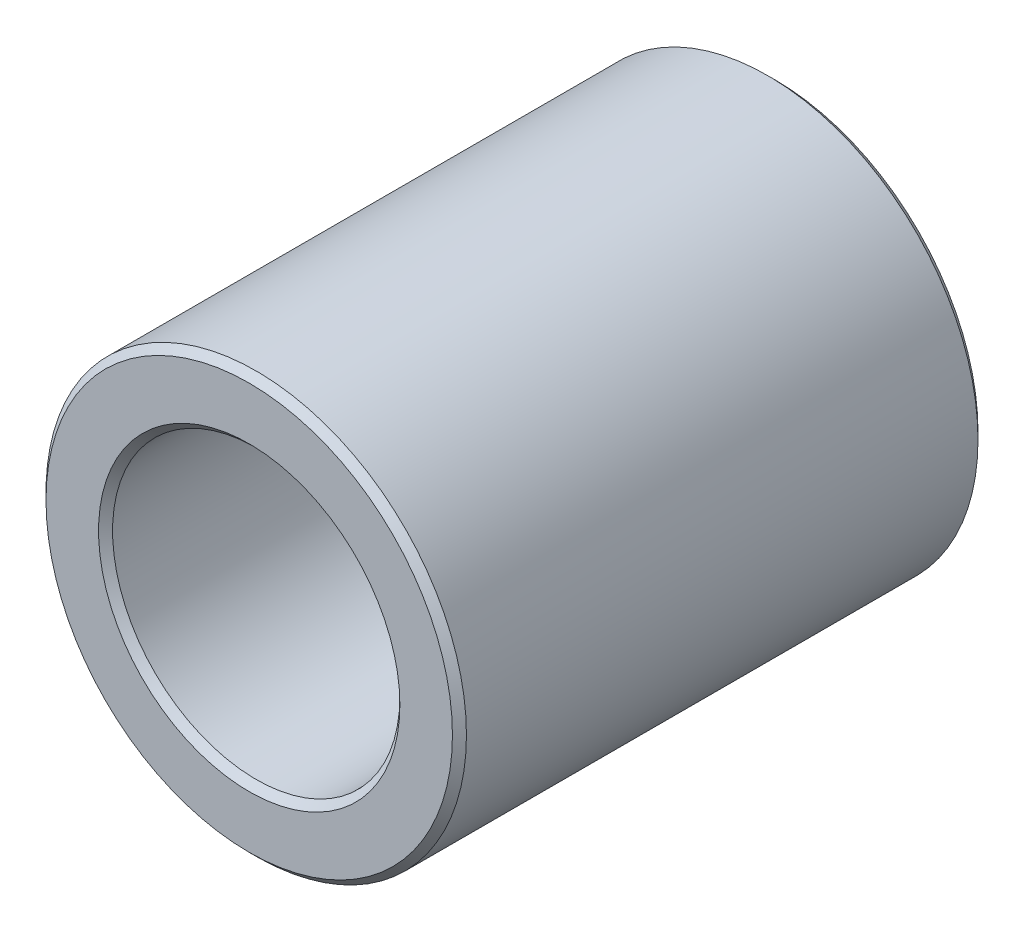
ISO-10303-21;
HEADER;
FILE_DESCRIPTION(('STEP AP214'),'2;1');
FILE_NAME('part.step','',(''),(''),'','','');
FILE_SCHEMA(('AUTOMOTIVE_DESIGN { 1 0 10303 214 1 1 1 1 }'));
ENDSEC;
DATA;
#1=APPLICATION_CONTEXT('core data for automotive mechanical design processes');
#2=APPLICATION_PROTOCOL_DEFINITION('international standard','automotive_design',2000,#1);
#3=PRODUCT_CONTEXT('',#1,'mechanical');
#4=PRODUCT('Part','Part','',(#3));
#5=PRODUCT_RELATED_PRODUCT_CATEGORY('part','',(#4));
#6=PRODUCT_DEFINITION_FORMATION('','',#4);
#7=PRODUCT_DEFINITION_CONTEXT('part definition',#1,'design');
#8=PRODUCT_DEFINITION('design','',#6,#7);
#9=PRODUCT_DEFINITION_SHAPE('','',#8);
#10=(LENGTH_UNIT() NAMED_UNIT(*) SI_UNIT(.MILLI.,.METRE.));
#11=(NAMED_UNIT(*) PLANE_ANGLE_UNIT() SI_UNIT($,.RADIAN.));
#12=(NAMED_UNIT(*) SI_UNIT($,.STERADIAN.) SOLID_ANGLE_UNIT());
#13=UNCERTAINTY_MEASURE_WITH_UNIT(LENGTH_MEASURE(1.E-05),#10,'distance_accuracy_value','');
#14=(GEOMETRIC_REPRESENTATION_CONTEXT(3) GLOBAL_UNCERTAINTY_ASSIGNED_CONTEXT((#13)) GLOBAL_UNIT_ASSIGNED_CONTEXT((#10,
#11,#12)) REPRESENTATION_CONTEXT('',''));
#15=CARTESIAN_POINT('',(0.,0.,0.));
#16=DIRECTION('',(0.,0.,1.));
#17=DIRECTION('',(1.,0.,0.));
#18=AXIS2_PLACEMENT_3D('',#15,#16,#17);
#19=CARTESIAN_POINT('',(0.,0.,7.5));
#20=DIRECTION('',(0.,0.,1.));
#21=DIRECTION('',(1.,0.,0.));
#22=AXIS2_PLACEMENT_3D('',#19,#20,#21);
#23=PLANE('',#22);
#24=CARTESIAN_POINT('',(0.,0.,7.5));
#25=DIRECTION('',(0.,0.,1.));
#26=DIRECTION('',(1.,0.,0.));
#27=AXIS2_PLACEMENT_3D('',#24,#25,#26);
#28=CIRCLE('',#27,4.3);
#29=CARTESIAN_POINT('',(4.3,0.,7.5));
#30=VERTEX_POINT('',#29);
#31=EDGE_CURVE('E10',#30,#30,#28,.F.);
#32=ORIENTED_EDGE('',*,*,#31,.T.);
#33=EDGE_LOOP('',(#32));
#34=FACE_BOUND('',#33,.T.);
#35=CARTESIAN_POINT('',(0.,0.,7.5));
#36=DIRECTION('',(0.,0.,1.));
#37=DIRECTION('',(1.,0.,0.));
#38=AXIS2_PLACEMENT_3D('',#35,#36,#37);
#39=CIRCLE('',#38,5.8);
#40=CARTESIAN_POINT('',(5.8,0.,7.5));
#41=VERTEX_POINT('',#40);
#42=EDGE_CURVE('E45',#41,#41,#39,.T.);
#43=ORIENTED_EDGE('',*,*,#42,.T.);
#44=EDGE_LOOP('',(#43));
#45=FACE_BOUND('',#44,.T.);
#46=ADVANCED_FACE('F37',(#34,#45),#23,.T.);
#47=CARTESIAN_POINT('',(0.,0.,-7.5));
#48=DIRECTION('',(0.,0.,1.));
#49=DIRECTION('',(1.,0.,0.));
#50=AXIS2_PLACEMENT_3D('',#47,#48,#49);
#51=PLANE('',#50);
#52=CARTESIAN_POINT('',(0.,0.,-7.5));
#53=DIRECTION('',(0.,0.,1.));
#54=DIRECTION('',(1.,0.,0.));
#55=AXIS2_PLACEMENT_3D('',#52,#53,#54);
#56=CIRCLE('',#55,5.8);
#57=CARTESIAN_POINT('',(5.8,0.,-7.5));
#58=VERTEX_POINT('',#57);
#59=EDGE_CURVE('E62',#58,#58,#56,.F.);
#60=ORIENTED_EDGE('',*,*,#59,.T.);
#61=EDGE_LOOP('',(#60));
#62=FACE_BOUND('',#61,.T.);
#63=CARTESIAN_POINT('',(0.,0.,-7.5));
#64=DIRECTION('',(0.,0.,1.));
#65=DIRECTION('',(1.,0.,0.));
#66=AXIS2_PLACEMENT_3D('',#63,#64,#65);
#67=CIRCLE('',#66,4.3);
#68=CARTESIAN_POINT('',(4.3,0.,-7.5));
#69=VERTEX_POINT('',#68);
#70=EDGE_CURVE('E65',#69,#69,#67,.T.);
#71=ORIENTED_EDGE('',*,*,#70,.T.);
#72=EDGE_LOOP('',(#71));
#73=FACE_BOUND('',#72,.T.);
#74=ADVANCED_FACE('F89',(#62,#73),#51,.F.);
#75=CARTESIAN_POINT('',(0.,0.,7.5));
#76=DIRECTION('',(0.,0.,-1.));
#77=DIRECTION('',(-1.,0.,0.));
#78=AXIS2_PLACEMENT_3D('',#75,#76,#77);
#79=CYLINDRICAL_SURFACE('',#78,6.);
#80=CARTESIAN_POINT('',(0.,0.,-7.3));
#81=DIRECTION('',(0.,0.,1.));
#82=DIRECTION('',(1.,0.,0.));
#83=AXIS2_PLACEMENT_3D('',#80,#81,#82);
#84=CIRCLE('',#83,6.);
#85=CARTESIAN_POINT('',(6.,0.,-7.3));
#86=VERTEX_POINT('',#85);
#87=EDGE_CURVE('E69',#86,#86,#84,.T.);
#88=ORIENTED_EDGE('',*,*,#87,.T.);
#89=EDGE_LOOP('',(#88));
#90=FACE_BOUND('',#89,.T.);
#91=CARTESIAN_POINT('',(0.,0.,7.3));
#92=DIRECTION('',(0.,0.,1.));
#93=DIRECTION('',(1.,0.,0.));
#94=AXIS2_PLACEMENT_3D('',#91,#92,#93);
#95=CIRCLE('',#94,6.);
#96=CARTESIAN_POINT('',(6.,0.,7.3));
#97=VERTEX_POINT('',#96);
#98=EDGE_CURVE('E73',#97,#97,#95,.F.);
#99=ORIENTED_EDGE('',*,*,#98,.T.);
#100=EDGE_LOOP('',(#99));
#101=FACE_BOUND('',#100,.T.);
#102=ADVANCED_FACE('F78',(#90,#101),#79,.T.);
#103=CARTESIAN_POINT('',(0.,0.,7.5));
#104=DIRECTION('',(0.,0.,-1.));
#105=DIRECTION('',(-1.,0.,0.));
#106=AXIS2_PLACEMENT_3D('',#103,#104,#105);
#107=CYLINDRICAL_SURFACE('',#106,4.1);
#108=CARTESIAN_POINT('',(0.,0.,-7.3));
#109=DIRECTION('',(0.,0.,1.));
#110=DIRECTION('',(1.,0.,0.));
#111=AXIS2_PLACEMENT_3D('',#108,#109,#110);
#112=CIRCLE('',#111,4.1);
#113=CARTESIAN_POINT('',(4.1,0.,-7.3));
#114=VERTEX_POINT('',#113);
#115=EDGE_CURVE('E51',#114,#114,#112,.F.);
#116=ORIENTED_EDGE('',*,*,#115,.T.);
#117=EDGE_LOOP('',(#116));
#118=FACE_BOUND('',#117,.T.);
#119=CARTESIAN_POINT('',(0.,0.,7.3));
#120=DIRECTION('',(0.,0.,1.));
#121=DIRECTION('',(1.,0.,0.));
#122=AXIS2_PLACEMENT_3D('',#119,#120,#121);
#123=CIRCLE('',#122,4.1);
#124=CARTESIAN_POINT('',(4.1,0.,7.3));
#125=VERTEX_POINT('',#124);
#126=EDGE_CURVE('E56',#125,#125,#123,.T.);
#127=ORIENTED_EDGE('',*,*,#126,.T.);
#128=EDGE_LOOP('',(#127));
#129=FACE_BOUND('',#128,.T.);
#130=ADVANCED_FACE('F97',(#118,#129),#107,.F.);
#131=CARTESIAN_POINT('',(0.,0.,-7.3));
#132=DIRECTION('',(0.,0.,1.));
#133=DIRECTION('',(1.,0.,0.));
#134=AXIS2_PLACEMENT_3D('',#131,#132,#133);
#135=CONICAL_SURFACE('',#134,6.,0.785398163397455);
#136=ORIENTED_EDGE('',*,*,#59,.F.);
#137=EDGE_LOOP('',(#136));
#138=FACE_BOUND('',#137,.T.);
#139=ORIENTED_EDGE('',*,*,#87,.F.);
#140=EDGE_LOOP('',(#139));
#141=FACE_BOUND('',#140,.T.);
#142=ADVANCED_FACE('F102',(#138,#141),#135,.T.);
#143=CARTESIAN_POINT('',(0.,0.,-7.5));
#144=DIRECTION('',(0.,0.,-1.));
#145=DIRECTION('',(-1.,0.,0.));
#146=AXIS2_PLACEMENT_3D('',#143,#144,#145);
#147=CONICAL_SURFACE('',#146,4.3,0.785398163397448);
#148=ORIENTED_EDGE('',*,*,#115,.F.);
#149=EDGE_LOOP('',(#148));
#150=FACE_BOUND('',#149,.T.);
#151=ORIENTED_EDGE('',*,*,#70,.F.);
#152=EDGE_LOOP('',(#151));
#153=FACE_BOUND('',#152,.T.);
#154=ADVANCED_FACE('F86',(#150,#153),#147,.F.);
#155=CARTESIAN_POINT('',(0.,0.,7.3));
#156=DIRECTION('',(0.,0.,1.));
#157=DIRECTION('',(1.,0.,0.));
#158=AXIS2_PLACEMENT_3D('',#155,#156,#157);
#159=CONICAL_SURFACE('',#158,4.1,0.785398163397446);
#160=CARTESIAN_POINT('',(4.3,0.,7.5));
#161=CARTESIAN_POINT('',(4.29791666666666,0.,7.49791666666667));
#162=CARTESIAN_POINT('',(4.29583333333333,0.,7.49583333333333));
#163=CARTESIAN_POINT('',(4.29166666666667,0.,7.49166666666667));
#164=CARTESIAN_POINT('',(4.28958333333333,0.,7.48958333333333));
#165=CARTESIAN_POINT('',(4.28541666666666,0.,7.48541666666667));
#166=CARTESIAN_POINT('',(4.28333333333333,0.,7.48333333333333));
#167=CARTESIAN_POINT('',(4.27916666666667,0.,7.47916666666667));
#168=CARTESIAN_POINT('',(4.27708333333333,0.,7.47708333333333));
#169=CARTESIAN_POINT('',(4.27291666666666,0.,7.47291666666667));
#170=CARTESIAN_POINT('',(4.27083333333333,0.,7.47083333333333));
#171=CARTESIAN_POINT('',(4.26666666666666,0.,7.46666666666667));
#172=CARTESIAN_POINT('',(4.26458333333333,0.,7.46458333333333));
#173=CARTESIAN_POINT('',(4.26041666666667,0.,7.46041666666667));
#174=CARTESIAN_POINT('',(4.25833333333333,0.,7.45833333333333));
#175=CARTESIAN_POINT('',(4.25416666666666,0.,7.45416666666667));
#176=CARTESIAN_POINT('',(4.25208333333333,0.,7.45208333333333));
#177=CARTESIAN_POINT('',(4.24791666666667,0.,7.44791666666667));
#178=CARTESIAN_POINT('',(4.24583333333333,0.,7.44583333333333));
#179=CARTESIAN_POINT('',(4.24166666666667,0.,7.44166666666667));
#180=CARTESIAN_POINT('',(4.23958333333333,0.,7.43958333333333));
#181=CARTESIAN_POINT('',(4.23541666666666,0.,7.43541666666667));
#182=CARTESIAN_POINT('',(4.23333333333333,0.,7.43333333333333));
#183=CARTESIAN_POINT('',(4.22916666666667,0.,7.42916666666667));
#184=CARTESIAN_POINT('',(4.22708333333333,0.,7.42708333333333));
#185=CARTESIAN_POINT('',(4.22291666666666,0.,7.42291666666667));
#186=CARTESIAN_POINT('',(4.22083333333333,0.,7.42083333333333));
#187=CARTESIAN_POINT('',(4.21666666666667,0.,7.41666666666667));
#188=CARTESIAN_POINT('',(4.21458333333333,0.,7.41458333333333));
#189=CARTESIAN_POINT('',(4.21041666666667,0.,7.41041666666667));
#190=CARTESIAN_POINT('',(4.20833333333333,0.,7.40833333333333));
#191=CARTESIAN_POINT('',(4.20416666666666,0.,7.40416666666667));
#192=CARTESIAN_POINT('',(4.20208333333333,0.,7.40208333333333));
#193=CARTESIAN_POINT('',(4.19791666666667,0.,7.39791666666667));
#194=CARTESIAN_POINT('',(4.19583333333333,0.,7.39583333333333));
#195=CARTESIAN_POINT('',(4.19166666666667,0.,7.39166666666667));
#196=CARTESIAN_POINT('',(4.18958333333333,0.,7.38958333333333));
#197=CARTESIAN_POINT('',(4.18541666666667,0.,7.38541666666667));
#198=CARTESIAN_POINT('',(4.18333333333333,0.,7.38333333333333));
#199=CARTESIAN_POINT('',(4.17916666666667,0.,7.37916666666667));
#200=CARTESIAN_POINT('',(4.17708333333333,0.,7.37708333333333));
#201=CARTESIAN_POINT('',(4.17291666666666,0.,7.37291666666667));
#202=CARTESIAN_POINT('',(4.17083333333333,0.,7.37083333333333));
#203=CARTESIAN_POINT('',(4.16666666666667,0.,7.36666666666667));
#204=CARTESIAN_POINT('',(4.16458333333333,0.,7.36458333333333));
#205=CARTESIAN_POINT('',(4.16041666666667,0.,7.36041666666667));
#206=CARTESIAN_POINT('',(4.15833333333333,0.,7.35833333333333));
#207=CARTESIAN_POINT('',(4.15416666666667,0.,7.35416666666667));
#208=CARTESIAN_POINT('',(4.15208333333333,0.,7.35208333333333));
#209=CARTESIAN_POINT('',(4.14791666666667,0.,7.34791666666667));
#210=CARTESIAN_POINT('',(4.14583333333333,0.,7.34583333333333));
#211=CARTESIAN_POINT('',(4.14166666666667,0.,7.34166666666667));
#212=CARTESIAN_POINT('',(4.13958333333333,0.,7.33958333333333));
#213=CARTESIAN_POINT('',(4.13541666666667,0.,7.33541666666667));
#214=CARTESIAN_POINT('',(4.13333333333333,0.,7.33333333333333));
#215=CARTESIAN_POINT('',(4.12916666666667,0.,7.32916666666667));
#216=CARTESIAN_POINT('',(4.12708333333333,0.,7.32708333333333));
#217=CARTESIAN_POINT('',(4.12291666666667,0.,7.32291666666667));
#218=CARTESIAN_POINT('',(4.12083333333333,0.,7.32083333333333));
#219=CARTESIAN_POINT('',(4.11666666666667,0.,7.31666666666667));
#220=CARTESIAN_POINT('',(4.11458333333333,0.,7.31458333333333));
#221=CARTESIAN_POINT('',(4.11041666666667,0.,7.31041666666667));
#222=CARTESIAN_POINT('',(4.10833333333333,0.,7.30833333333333));
#223=CARTESIAN_POINT('',(4.10416666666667,0.,7.30416666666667));
#224=CARTESIAN_POINT('',(4.10208333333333,0.,7.30208333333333));
#225=CARTESIAN_POINT('',(4.1,0.,7.3));
#226=B_SPLINE_CURVE_WITH_KNOTS('',3,(#160,#161,#162,#163,#164,#165,#166,#167,#168,#169,#170,
#171,#172,#173,#174,#175,#176,#177,#178,#179,#180,#181,#182,#183,#184,#185,#186,#187,#188,#189,
#190,#191,#192,#193,#194,#195,#196,#197,#198,#199,#200,#201,#202,#203,#204,#205,#206,#207,#208,
#209,#210,#211,#212,#213,#214,#215,#216,#217,#218,#219,#220,#221,#222,#223,#224,#225),
.UNSPECIFIED.,.F.,.F.,(4,2,2,2,2,2,2,2,2,2,2,2,2,2,2,2,2,2,2,2,2,2,2,2,2,2,2,2,2,2,2,2,4),(0.,
0.00883883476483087,0.017677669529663,0.0265165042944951,0.0353553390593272,0.044194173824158,
0.0530330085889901,0.0618718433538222,0.0707106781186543,0.0795495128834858,0.0883883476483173,
0.0972271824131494,0.106066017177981,0.114904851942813,0.123743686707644,0.132582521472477,
0.141421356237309,0.15026019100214,0.159099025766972,0.167937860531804,0.176776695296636,
0.185615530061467,0.194454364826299,0.203293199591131,0.212132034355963,0.220970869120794,
0.229809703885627,0.238648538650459,0.24748737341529,0.256326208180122,0.265165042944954,
0.274003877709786,0.282842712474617),.UNSPECIFIED.);
#227=EDGE_CURVE('BSEAM82',#30,#125,#226,.T.);
#228=ORIENTED_EDGE('',*,*,#31,.F.);
#229=ORIENTED_EDGE('',*,*,#126,.F.);
#230=ORIENTED_EDGE('',*,*,#227,.T.);
#231=ORIENTED_EDGE('',*,*,#227,.F.);
#232=EDGE_LOOP('',(#228,#230,#229,#231));
#233=FACE_BOUND('',#232,.T.);
#234=ADVANCED_FACE('F82',(#233),#159,.F.);
#235=CARTESIAN_POINT('',(0.,0.,7.5));
#236=DIRECTION('',(0.,0.,-1.));
#237=DIRECTION('',(-1.,0.,0.));
#238=AXIS2_PLACEMENT_3D('',#235,#236,#237);
#239=CONICAL_SURFACE('',#238,5.8,0.785398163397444);
#240=ORIENTED_EDGE('',*,*,#98,.F.);
#241=EDGE_LOOP('',(#240));
#242=FACE_BOUND('',#241,.T.);
#243=ORIENTED_EDGE('',*,*,#42,.F.);
#244=EDGE_LOOP('',(#243));
#245=FACE_BOUND('',#244,.T.);
#246=ADVANCED_FACE('F39',(#242,#245),#239,.T.);
#247=CLOSED_SHELL('',(#46,#74,#102,#130,#142,#154,#234,#246));
#248=MANIFOLD_SOLID_BREP('B2',#247);
#249=ADVANCED_BREP_SHAPE_REPRESENTATION('',(#18,#248),#14);
#250=SHAPE_DEFINITION_REPRESENTATION(#9,#249);
ENDSEC;
END-ISO-10303-21;
